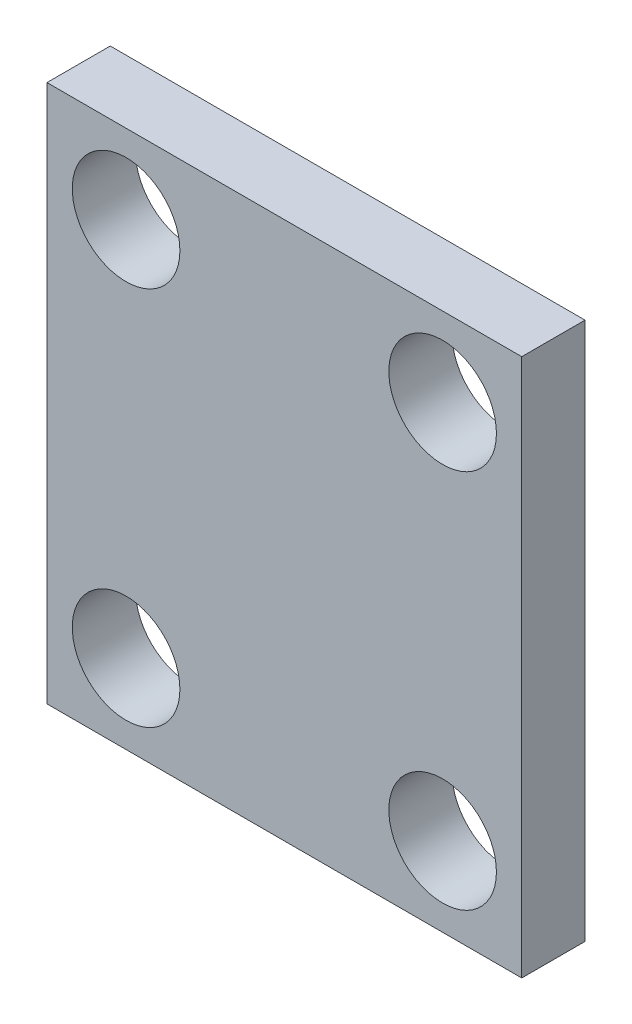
from build123d import *

# Parameters (mm, degrees)
ESQUISSE1_W                     = 15
ESQUISSE1_H                     = 17
EXTRUSION1_DEPTH                = 2
D_GAGEMENT_M31_D                = 3.4
R_P_TITION_LIN_AIRE1_COUNT      = 2
R_P_TITION_LIN_AIRE1_PITCH      = 10
R_P_TITION_LIN_AIRE1_COUNT_DIR2 = 2
R_P_TITION_LIN_AIRE1_PITCH_DIR2 = 12


with BuildPart() as part:
    # Esquisse1 → Extrusion1 (new body)
    with BuildSketch(Plane.XY):
        with Locations((7.5, 8.5)):
            Rectangle(ESQUISSE1_W, ESQUISSE1_H)
    extrude(amount=EXTRUSION1_DEPTH)

    # D_gagement M31 (through all)
    with Locations(Plane.XY.offset(2)):
        with Locations((2.5, 14.5)):
            d_gagement_m31 = Hole(D_GAGEMENT_M31_D / 2)

    # R_p_tition lin_aire1: D_gagement M31 2 × 2
    with Locations(*[(i * R_P_TITION_LIN_AIRE1_PITCH, -j * R_P_TITION_LIN_AIRE1_PITCH_DIR2, 0) for i in range(R_P_TITION_LIN_AIRE1_COUNT) for j in range(R_P_TITION_LIN_AIRE1_COUNT_DIR2) if (i, j) != (0, 0)]):
        add(d_gagement_m31, mode=Mode.SUBTRACT)


solid = part.part
